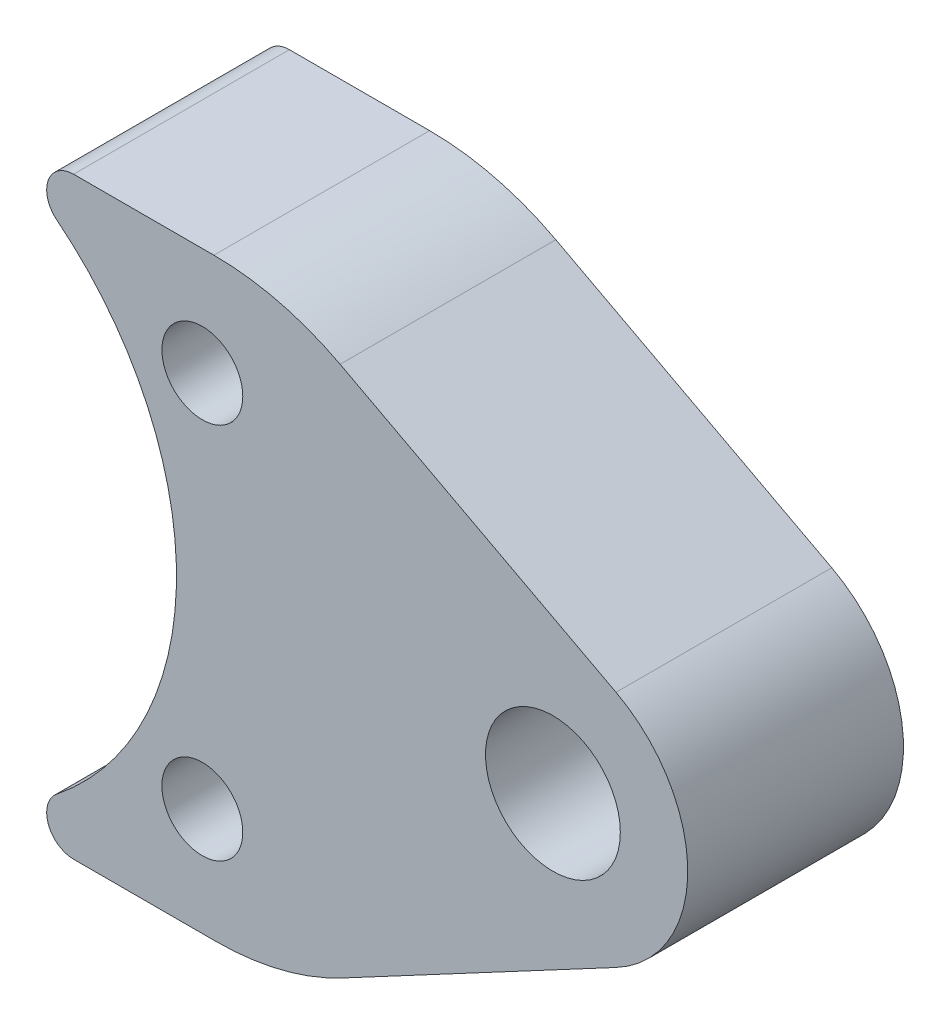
from build123d import *

# Parameters (mm, degrees)
ESQUISSE1_R      = 1.5
ESQUISSE1_R_2    = 2.5
EXTRUSION1_DEPTH = 8
CONG_1_R         = 10


with BuildPart() as part:
    # Esquisse1 → Extrusion1 (new body)
    with BuildSketch(Plane.XY):
        with BuildLine():
            Line((20, -11), (12.227935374, -11))
            ThreePointArc((12.227935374, -11), (11.28408436, -10.330371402), (11.604292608, -9.218290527))
            ThreePointArc((11.604292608, -9.218290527), (16.042476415, 0), (11.604292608, 9.218290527))
            ThreePointArc((11.604292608, 9.218290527), (11.28408436, 10.330371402), (12.227935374, 11))
            Line((12.227935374, 11), (19.913276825, 11))
            Line((19.913276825, 11), (32.34013407, 4.418571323))
            ThreePointArc((32.34013407, 4.418571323), (34.999994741, 0.007251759), (32.352941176, -4.411764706))
            Line((32.352941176, -4.411764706), (20, -11))
        make_face()
        with Locations((17, 7)):
            Circle(ESQUISSE1_R, mode=Mode.SUBTRACT)
        with Locations(Location((17, -7, 0), (0, 0, 180))):
            Circle(ESQUISSE1_R, mode=Mode.SUBTRACT)
        with Locations((30, 0)):
            Circle(ESQUISSE1_R_2, mode=Mode.SUBTRACT)
    extrude(amount=EXTRUSION1_DEPTH)

    # Cong_1
    cong_1_edges = [part.edges().sort_by_distance(p)[0] for p in [
        (19.913276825, 11, 4),
        (20, -11, 4),
    ]]
    fillet(cong_1_edges, radius=CONG_1_R)


solid = part.part
